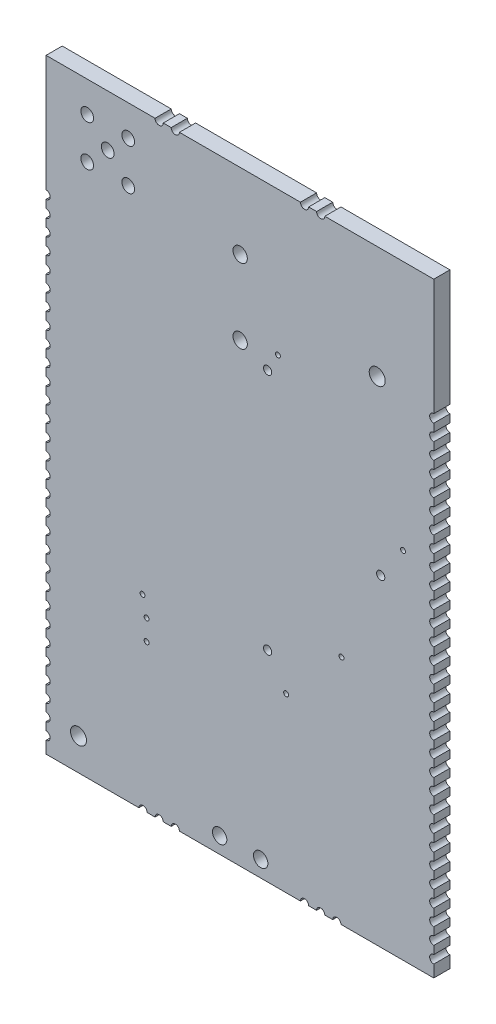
from build123d import *

# Parameters (mm, degrees)
BOARD_OUTLINE_DEPTH = 1
SKETCH2_R           = 0.4953
SKETCH2_R_2         = 0.254
NPTH_DEPTH          = 42.758947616
SKETCH3_R           = 0.1524
SKETCH3_R_2         = 0.254
SKETCH3_R_3         = 0.4445
SKETCH3_R_4         = 0.3937
PTH_DEPTH           = 42.758947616


with BuildPart() as part:
    # Sketch1 → Board_Outline (new body)
    with BuildSketch(Plane.XY):
        Polygon((-2.0066, -1.9812), (21.9934, -1.9812), (21.993352, 35.4838), (-2.0066, 35.4838), align=None)
    extrude(amount=BOARD_OUTLINE_DEPTH)

    # Sketch2 → NPTH (cut, through all)
    with BuildSketch(Plane.XY):
        Circle(SKETCH2_R)
        with Locations((18.4934, 28.5188)):
            Circle(SKETCH2_R)
        with Locations((11.7094, 10.4578)):
            Circle(SKETCH2_R_2)
        with Locations((11.7094, 25.4578)):
            Circle(SKETCH2_R_2)
        with Locations((18.7094, 17.9578)):
            Circle(SKETCH2_R_2)
    extrude(amount=NPTH_DEPTH, mode=Mode.SUBTRACT)

    # Sketch3 → PTH (cut, through all)
    with BuildSketch(Plane.XY):
        with Locations((3.9624, 9.5758)):
            Circle(SKETCH3_R)
        with Locations((12.3444, 26.5938)):
            Circle(SKETCH3_R)
        with Locations((4.2164, 8.4328)):
            Circle(SKETCH3_R)
        with Locations((4.2164, 7.1628)):
            Circle(SKETCH3_R)
        with Locations((16.2814, 12.3698)):
            Circle(SKETCH3_R)
        with Locations((12.8524, 8.6868)):
            Circle(SKETCH3_R)
        with Locations((20.0914, 19.9898)):
            Circle(SKETCH3_R)
        with Locations((-2.0066, 28.0188)):
            Circle(SKETCH3_R_2)
        with Locations((-2.0066, 19.0188)):
            Circle(SKETCH3_R_2)
        with Locations((-2.0066, 18.0188)):
            Circle(SKETCH3_R_2)
        with Locations((-2.0066, 17.0188)):
            Circle(SKETCH3_R_2)
        with Locations((-2.0066, 16.0188)):
            Circle(SKETCH3_R_2)
        with Locations((-2.0066, 15.0188)):
            Circle(SKETCH3_R_2)
        with Locations((-2.0066, 14.0188)):
            Circle(SKETCH3_R_2)
        with Locations((-2.0066, 13.0188)):
            Circle(SKETCH3_R_2)
        with Locations((-2.0066, 12.0188)):
            Circle(SKETCH3_R_2)
        with Locations((-2.0066, 11.0188)):
            Circle(SKETCH3_R_2)
        with Locations((-2.0066, 10.0188)):
            Circle(SKETCH3_R_2)
        with Locations((-2.0066, 27.0188)):
            Circle(SKETCH3_R_2)
        with Locations((-2.0066, 9.0188)):
            Circle(SKETCH3_R_2)
        with Locations((-2.0066, 8.0188)):
            Circle(SKETCH3_R_2)
        with Locations((-2.0066, 7.0188)):
            Circle(SKETCH3_R_2)
        with Locations((-2.0066, 6.0188)):
            Circle(SKETCH3_R_2)
        with Locations((-2.0066, 5.0188)):
            Circle(SKETCH3_R_2)
        with Locations((-2.0066, 4.0188)):
            Circle(SKETCH3_R_2)
        with Locations((-2.0066, 3.0188)):
            Circle(SKETCH3_R_2)
        with Locations((-2.0066, 2.0188)):
            Circle(SKETCH3_R_2)
        with Locations((-2.0066, 1.0188)):
            Circle(SKETCH3_R_2)
        with Locations((-2.0066, 0.0188)):
            Circle(SKETCH3_R_2)
        with Locations((-2.0066, 26.0188)):
            Circle(SKETCH3_R_2)
        with Locations((-2.0066, -0.9812)):
            Circle(SKETCH3_R_2)
        with Locations((3.9934, -1.9812)):
            Circle(SKETCH3_R_2)
        with Locations((4.9934, -1.9812)):
            Circle(SKETCH3_R_2)
        with Locations((5.9934, -1.9812)):
            Circle(SKETCH3_R_2)
        with Locations((13.9934, -1.9812)):
            Circle(SKETCH3_R_2)
        with Locations((14.9934, -1.9812)):
            Circle(SKETCH3_R_2)
        with Locations((15.9934, -1.9812)):
            Circle(SKETCH3_R_2)
        with Locations((21.9934, -0.9812)):
            Circle(SKETCH3_R_2)
        with Locations((21.9934, 0.0188)):
            Circle(SKETCH3_R_2)
        with Locations((21.9934, 1.0188)):
            Circle(SKETCH3_R_2)
        with Locations((-2.0066, 25.0188)):
            Circle(SKETCH3_R_2)
        with Locations((21.9934, 2.0188)):
            Circle(SKETCH3_R_2)
        with Locations((21.9934, 3.0188)):
            Circle(SKETCH3_R_2)
        with Locations((21.9934, 4.0188)):
            Circle(SKETCH3_R_2)
        with Locations((21.9934, 5.0188)):
            Circle(SKETCH3_R_2)
        with Locations((21.9934, 6.0188)):
            Circle(SKETCH3_R_2)
        with Locations((21.9934, 7.0188)):
            Circle(SKETCH3_R_2)
        with Locations((21.9934, 8.0188)):
            Circle(SKETCH3_R_2)
        with Locations((21.9934, 9.0188)):
            Circle(SKETCH3_R_2)
        with Locations((21.9934, 10.0188)):
            Circle(SKETCH3_R_2)
        with Locations((21.9934, 11.0188)):
            Circle(SKETCH3_R_2)
        with Locations((-2.0066, 24.0188)):
            Circle(SKETCH3_R_2)
        with Locations((21.9934, 12.0188)):
            Circle(SKETCH3_R_2)
        with Locations((21.9934, 13.0188)):
            Circle(SKETCH3_R_2)
        with Locations((21.9934, 14.0188)):
            Circle(SKETCH3_R_2)
        with Locations((21.9934, 15.0188)):
            Circle(SKETCH3_R_2)
        with Locations((21.9934, 16.0188)):
            Circle(SKETCH3_R_2)
        with Locations((21.9934, 17.0188)):
            Circle(SKETCH3_R_2)
        with Locations((21.9934, 18.0188)):
            Circle(SKETCH3_R_2)
        with Locations((21.9934, 19.0188)):
            Circle(SKETCH3_R_2)
        with Locations((21.9934, 20.0188)):
            Circle(SKETCH3_R_2)
        with Locations((21.9934, 21.0188)):
            Circle(SKETCH3_R_2)
        with Locations((-2.0066, 23.0188)):
            Circle(SKETCH3_R_2)
        with Locations((21.9934, 22.0188)):
            Circle(SKETCH3_R_2)
        with Locations((21.9934, 23.0188)):
            Circle(SKETCH3_R_2)
        with Locations((21.9934, 24.0188)):
            Circle(SKETCH3_R_2)
        with Locations((21.9934, 25.0188)):
            Circle(SKETCH3_R_2)
        with Locations((21.9934, 26.0188)):
            Circle(SKETCH3_R_2)
        with Locations((21.9934, 27.0188)):
            Circle(SKETCH3_R_2)
        with Locations((21.9934, 28.0188)):
            Circle(SKETCH3_R_2)
        with Locations((-2.0066, 22.0188)):
            Circle(SKETCH3_R_2)
        with Locations((-2.0066, 21.0188)):
            Circle(SKETCH3_R_2)
        with Locations((-2.0066, 20.0188)):
            Circle(SKETCH3_R_2)
        with Locations((13.9934, 35.4838)):
            Circle(SKETCH3_R_2)
        with Locations((4.9934, 35.4838)):
            Circle(SKETCH3_R_2)
        with Locations((14.9934, 35.4838)):
            Circle(SKETCH3_R_2)
        with Locations((5.9934, 35.4838)):
            Circle(SKETCH3_R_2)
        with Locations((10.0076, 26.2188)):
            Circle(SKETCH3_R_3)
        with Locations((11.2776, -0.9812)):
            Circle(SKETCH3_R_3)
        with Locations((8.7376, -0.9812)):
            Circle(SKETCH3_R_3)
        with Locations((10.0076, 30.8188)):
            Circle(SKETCH3_R_3)
        with Locations((1.809, 32.3088)):
            Circle(SKETCH3_R_4)
        with Locations((0.539, 31.0388)):
            Circle(SKETCH3_R_4)
        with Locations((3.079, 31.0388)):
            Circle(SKETCH3_R_4)
        with Locations((3.079, 33.5788)):
            Circle(SKETCH3_R_4)
        with Locations((0.539, 33.5788)):
            Circle(SKETCH3_R_4)
    extrude(amount=PTH_DEPTH, mode=Mode.SUBTRACT)


solid = part.part
